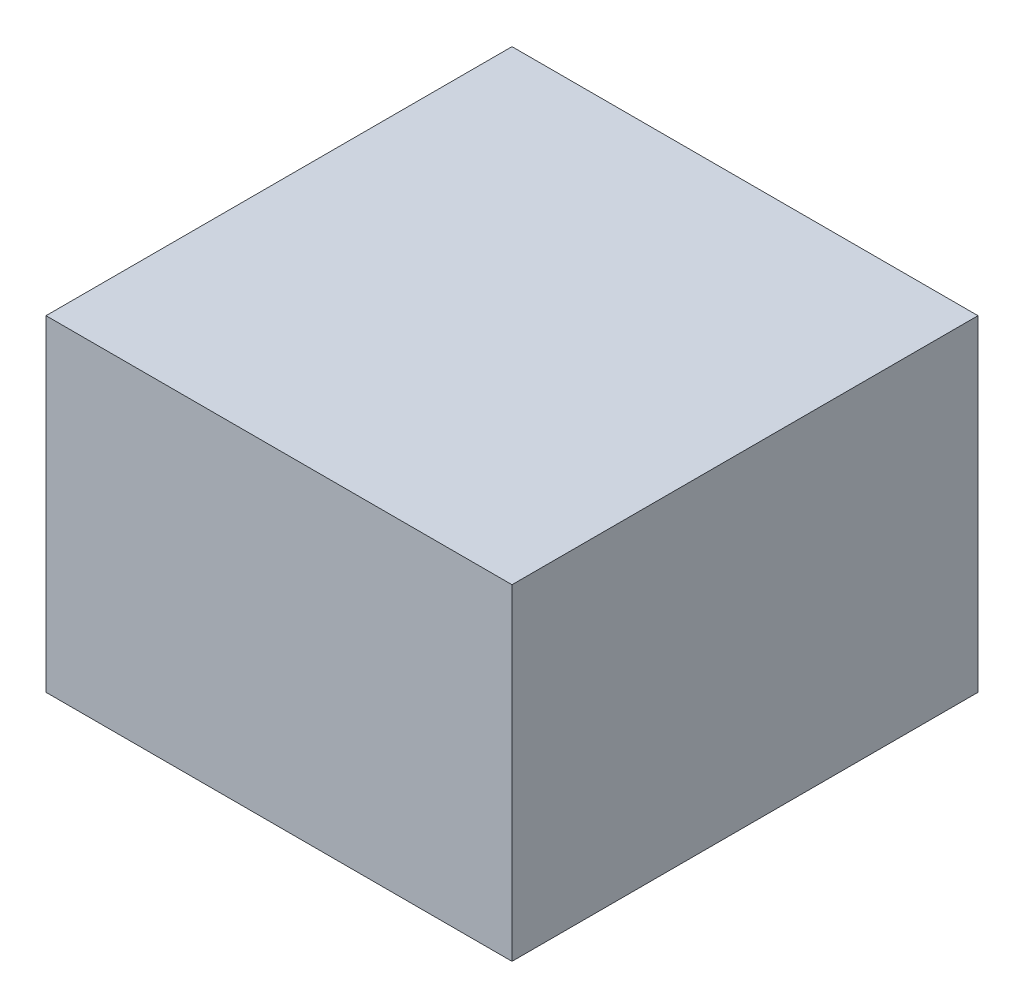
ISO-10303-21;
HEADER;
FILE_DESCRIPTION(('STEP AP214'),'2;1');
FILE_NAME('part.step','',(''),(''),'','','');
FILE_SCHEMA(('AUTOMOTIVE_DESIGN { 1 0 10303 214 1 1 1 1 }'));
ENDSEC;
DATA;
#1=APPLICATION_CONTEXT('core data for automotive mechanical design processes');
#2=APPLICATION_PROTOCOL_DEFINITION('international standard','automotive_design',2000,#1);
#3=PRODUCT_CONTEXT('',#1,'mechanical');
#4=PRODUCT('Part','Part','',(#3));
#5=PRODUCT_RELATED_PRODUCT_CATEGORY('part','',(#4));
#6=PRODUCT_DEFINITION_FORMATION('','',#4);
#7=PRODUCT_DEFINITION_CONTEXT('part definition',#1,'design');
#8=PRODUCT_DEFINITION('design','',#6,#7);
#9=PRODUCT_DEFINITION_SHAPE('','',#8);
#10=(LENGTH_UNIT() NAMED_UNIT(*) SI_UNIT(.MILLI.,.METRE.));
#11=(NAMED_UNIT(*) PLANE_ANGLE_UNIT() SI_UNIT($,.RADIAN.));
#12=(NAMED_UNIT(*) SI_UNIT($,.STERADIAN.) SOLID_ANGLE_UNIT());
#13=UNCERTAINTY_MEASURE_WITH_UNIT(LENGTH_MEASURE(1.E-05),#10,'distance_accuracy_value','');
#14=(GEOMETRIC_REPRESENTATION_CONTEXT(3) GLOBAL_UNCERTAINTY_ASSIGNED_CONTEXT((#13)) GLOBAL_UNIT_ASSIGNED_CONTEXT((#10,
#11,#12)) REPRESENTATION_CONTEXT('',''));
#15=CARTESIAN_POINT('',(0.,0.,0.));
#16=DIRECTION('',(0.,0.,1.));
#17=DIRECTION('',(1.,0.,0.));
#18=AXIS2_PLACEMENT_3D('',#15,#16,#17);
#19=CARTESIAN_POINT('',(22.5,31.5,22.5));
#20=DIRECTION('',(-1.,0.,0.));
#21=DIRECTION('',(0.,0.,1.));
#22=AXIS2_PLACEMENT_3D('',#19,#20,#21);
#23=PLANE('',#22);
#24=DIRECTION('',(0.,0.,-1.));
#25=VECTOR('',#24,1.);
#26=CARTESIAN_POINT('',(22.5,0.,22.5));
#27=LINE('',#26,#25);
#28=CARTESIAN_POINT('',(22.5,0.,22.5));
#29=VERTEX_POINT('',#28);
#30=CARTESIAN_POINT('',(22.5,0.,-22.5));
#31=VERTEX_POINT('',#30);
#32=EDGE_CURVE('E100',#29,#31,#27,.T.);
#33=ORIENTED_EDGE('',*,*,#32,.T.);
#34=DIRECTION('',(0.,-1.,0.));
#35=VECTOR('',#34,1.);
#36=CARTESIAN_POINT('',(22.5,31.5,-22.5));
#37=LINE('',#36,#35);
#38=CARTESIAN_POINT('',(22.5,31.5,-22.5));
#39=VERTEX_POINT('',#38);
#40=EDGE_CURVE('E11',#39,#31,#37,.T.);
#41=ORIENTED_EDGE('',*,*,#40,.F.);
#42=DIRECTION('',(0.,0.,-1.));
#43=VECTOR('',#42,1.);
#44=CARTESIAN_POINT('',(22.5,31.5,22.5));
#45=LINE('',#44,#43);
#46=CARTESIAN_POINT('',(22.5,31.5,22.5));
#47=VERTEX_POINT('',#46);
#48=EDGE_CURVE('E88',#47,#39,#45,.T.);
#49=ORIENTED_EDGE('',*,*,#48,.F.);
#50=DIRECTION('',(0.,-1.,0.));
#51=VECTOR('',#50,1.);
#52=CARTESIAN_POINT('',(22.5,31.5,22.5));
#53=LINE('',#52,#51);
#54=EDGE_CURVE('E96',#47,#29,#53,.T.);
#55=ORIENTED_EDGE('',*,*,#54,.T.);
#56=EDGE_LOOP('',(#33,#41,#49,#55));
#57=FACE_BOUND('',#56,.T.);
#58=ADVANCED_FACE('F37',(#57),#23,.F.);
#59=CARTESIAN_POINT('',(-22.5,31.5,-22.5));
#60=DIRECTION('',(0.,0.,1.));
#61=DIRECTION('',(1.,0.,0.));
#62=AXIS2_PLACEMENT_3D('',#59,#60,#61);
#63=PLANE('',#62);
#64=DIRECTION('',(-1.,0.,0.));
#65=VECTOR('',#64,1.);
#66=CARTESIAN_POINT('',(-22.5,0.,-22.5));
#67=LINE('',#66,#65);
#68=CARTESIAN_POINT('',(-22.5,0.,-22.5));
#69=VERTEX_POINT('',#68);
#70=EDGE_CURVE('E92',#31,#69,#67,.T.);
#71=ORIENTED_EDGE('',*,*,#70,.T.);
#72=DIRECTION('',(0.,-1.,0.));
#73=VECTOR('',#72,1.);
#74=CARTESIAN_POINT('',(-22.5,31.5,-22.5));
#75=LINE('',#74,#73);
#76=CARTESIAN_POINT('',(-22.5,31.5,-22.5));
#77=VERTEX_POINT('',#76);
#78=EDGE_CURVE('E45',#77,#69,#75,.T.);
#79=ORIENTED_EDGE('',*,*,#78,.F.);
#80=DIRECTION('',(-1.,0.,0.));
#81=VECTOR('',#80,1.);
#82=CARTESIAN_POINT('',(-22.5,31.5,-22.5));
#83=LINE('',#82,#81);
#84=EDGE_CURVE('E83',#39,#77,#83,.T.);
#85=ORIENTED_EDGE('',*,*,#84,.F.);
#86=ORIENTED_EDGE('',*,*,#40,.T.);
#87=EDGE_LOOP('',(#71,#79,#85,#86));
#88=FACE_BOUND('',#87,.T.);
#89=ADVANCED_FACE('F91',(#88),#63,.F.);
#90=CARTESIAN_POINT('',(-22.5,31.5,22.5));
#91=DIRECTION('',(1.,0.,0.));
#92=DIRECTION('',(0.,0.,-1.));
#93=AXIS2_PLACEMENT_3D('',#90,#91,#92);
#94=PLANE('',#93);
#95=DIRECTION('',(0.,0.,1.));
#96=VECTOR('',#95,1.);
#97=CARTESIAN_POINT('',(-22.5,0.,22.5));
#98=LINE('',#97,#96);
#99=CARTESIAN_POINT('',(-22.5,0.,22.5));
#100=VERTEX_POINT('',#99);
#101=EDGE_CURVE('E70',#69,#100,#98,.T.);
#102=ORIENTED_EDGE('',*,*,#101,.T.);
#103=DIRECTION('',(0.,-1.,0.));
#104=VECTOR('',#103,1.);
#105=CARTESIAN_POINT('',(-22.5,31.5,22.5));
#106=LINE('',#105,#104);
#107=CARTESIAN_POINT('',(-22.5,31.5,22.5));
#108=VERTEX_POINT('',#107);
#109=EDGE_CURVE('E93',#108,#100,#106,.T.);
#110=ORIENTED_EDGE('',*,*,#109,.F.);
#111=DIRECTION('',(0.,0.,1.));
#112=VECTOR('',#111,1.);
#113=CARTESIAN_POINT('',(-22.5,31.5,22.5));
#114=LINE('',#113,#112);
#115=EDGE_CURVE('E86',#77,#108,#114,.T.);
#116=ORIENTED_EDGE('',*,*,#115,.F.);
#117=ORIENTED_EDGE('',*,*,#78,.T.);
#118=EDGE_LOOP('',(#102,#110,#116,#117));
#119=FACE_BOUND('',#118,.T.);
#120=ADVANCED_FACE('F94',(#119),#94,.F.);
#121=CARTESIAN_POINT('',(-22.5,31.5,22.5));
#122=DIRECTION('',(0.,0.,-1.));
#123=DIRECTION('',(-1.,0.,0.));
#124=AXIS2_PLACEMENT_3D('',#121,#122,#123);
#125=PLANE('',#124);
#126=DIRECTION('',(1.,0.,0.));
#127=VECTOR('',#126,1.);
#128=CARTESIAN_POINT('',(-22.5,0.,22.5));
#129=LINE('',#128,#127);
#130=EDGE_CURVE('E76',#100,#29,#129,.T.);
#131=ORIENTED_EDGE('',*,*,#130,.T.);
#132=ORIENTED_EDGE('',*,*,#54,.F.);
#133=DIRECTION('',(1.,0.,0.));
#134=VECTOR('',#133,1.);
#135=CARTESIAN_POINT('',(-22.5,31.5,22.5));
#136=LINE('',#135,#134);
#137=EDGE_CURVE('E53',#108,#47,#136,.T.);
#138=ORIENTED_EDGE('',*,*,#137,.F.);
#139=ORIENTED_EDGE('',*,*,#109,.T.);
#140=EDGE_LOOP('',(#131,#132,#138,#139));
#141=FACE_BOUND('',#140,.T.);
#142=ADVANCED_FACE('F107',(#141),#125,.F.);
#143=CARTESIAN_POINT('',(0.,31.5,0.));
#144=DIRECTION('',(0.,-1.,0.));
#145=DIRECTION('',(0.,0.,-1.));
#146=AXIS2_PLACEMENT_3D('',#143,#144,#145);
#147=PLANE('',#146);
#148=ORIENTED_EDGE('',*,*,#48,.T.);
#149=ORIENTED_EDGE('',*,*,#84,.T.);
#150=ORIENTED_EDGE('',*,*,#115,.T.);
#151=ORIENTED_EDGE('',*,*,#137,.T.);
#152=EDGE_LOOP('',(#148,#149,#150,#151));
#153=FACE_BOUND('',#152,.T.);
#154=ADVANCED_FACE('F84',(#153),#147,.F.);
#155=CARTESIAN_POINT('',(0.,0.,0.));
#156=DIRECTION('',(0.,-1.,0.));
#157=DIRECTION('',(0.,0.,-1.));
#158=AXIS2_PLACEMENT_3D('',#155,#156,#157);
#159=PLANE('',#158);
#160=ORIENTED_EDGE('',*,*,#32,.F.);
#161=ORIENTED_EDGE('',*,*,#130,.F.);
#162=ORIENTED_EDGE('',*,*,#101,.F.);
#163=ORIENTED_EDGE('',*,*,#70,.F.);
#164=EDGE_LOOP('',(#160,#161,#162,#163));
#165=FACE_BOUND('',#164,.T.);
#166=ADVANCED_FACE('F110',(#165),#159,.T.);
#167=CLOSED_SHELL('',(#58,#89,#120,#142,#154,#166));
#168=MANIFOLD_SOLID_BREP('B2',#167);
#169=ADVANCED_BREP_SHAPE_REPRESENTATION('',(#18,#168),#14);
#170=SHAPE_DEFINITION_REPRESENTATION(#9,#169);
ENDSEC;
END-ISO-10303-21;
